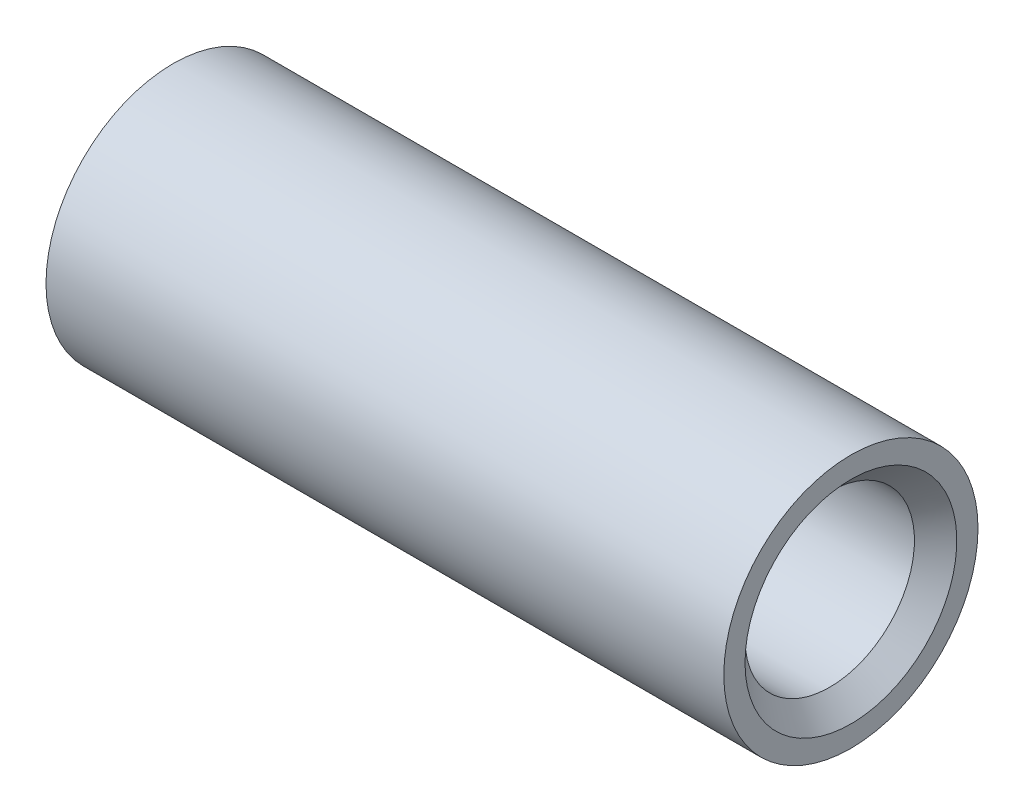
from build123d import *

# Parameters (mm, degrees)
ESQUISSE1_W     = 32
ESQUISSE1_H     = 2
CHANFREIN1_SIZE = 1


with BuildPart() as part:
    # Esquisse1 → R_volution1 (revolve)
    with BuildSketch(Plane.XY, mode=Mode.PRIVATE) as r_volution1_sk:
        with Locations((0, 5)):
            Rectangle(ESQUISSE1_W, ESQUISSE1_H)
    revolve(r_volution1_sk.sketch.rotate(Axis((-63.776227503, 0, 0), (1, 0, 0)), 90), axis=Axis((-63.776227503, 0, 0), (1, 0, 0)))

    # Chanfrein1
    chanfrein1_edges = [part.edges().sort_by_distance(p)[0] for p in [
        (-16, 0, -4),
        (16, 0, -4),
    ]]
    chamfer(chanfrein1_edges, length=CHANFREIN1_SIZE)


solid = part.part
